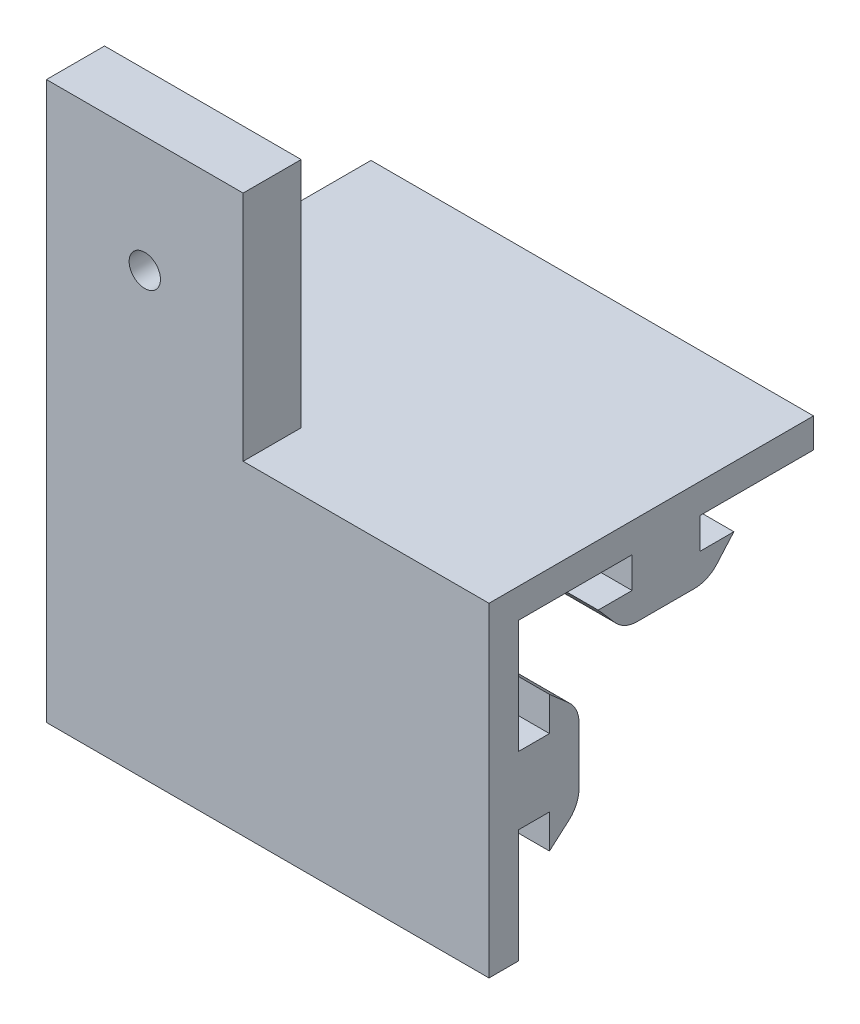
ISO-10303-21;
HEADER;
FILE_DESCRIPTION(('STEP AP214'),'2;1');
FILE_NAME('part.step','',(''),(''),'','','');
FILE_SCHEMA(('AUTOMOTIVE_DESIGN { 1 0 10303 214 1 1 1 1 }'));
ENDSEC;
DATA;
#1=APPLICATION_CONTEXT('core data for automotive mechanical design processes');
#2=APPLICATION_PROTOCOL_DEFINITION('international standard','automotive_design',2000,#1);
#3=PRODUCT_CONTEXT('',#1,'mechanical');
#4=PRODUCT('Part','Part','',(#3));
#5=PRODUCT_RELATED_PRODUCT_CATEGORY('part','',(#4));
#6=PRODUCT_DEFINITION_FORMATION('','',#4);
#7=PRODUCT_DEFINITION_CONTEXT('part definition',#1,'design');
#8=PRODUCT_DEFINITION('design','',#6,#7);
#9=PRODUCT_DEFINITION_SHAPE('','',#8);
#10=(LENGTH_UNIT() NAMED_UNIT(*) SI_UNIT(.MILLI.,.METRE.));
#11=(NAMED_UNIT(*) PLANE_ANGLE_UNIT() SI_UNIT($,.RADIAN.));
#12=(NAMED_UNIT(*) SI_UNIT($,.STERADIAN.) SOLID_ANGLE_UNIT());
#13=UNCERTAINTY_MEASURE_WITH_UNIT(LENGTH_MEASURE(1.E-05),#10,'distance_accuracy_value','');
#14=(GEOMETRIC_REPRESENTATION_CONTEXT(3) GLOBAL_UNCERTAINTY_ASSIGNED_CONTEXT((#13)) GLOBAL_UNIT_ASSIGNED_CONTEXT((#10,
#11,#12)) REPRESENTATION_CONTEXT('',''));
#15=CARTESIAN_POINT('',(0.,0.,0.));
#16=DIRECTION('',(0.,0.,1.));
#17=DIRECTION('',(1.,0.,0.));
#18=AXIS2_PLACEMENT_3D('',#15,#16,#17);
#19=CARTESIAN_POINT('',(0.,0.,0.));
#20=DIRECTION('',(0.,0.,-1.));
#21=DIRECTION('',(-1.,0.,0.));
#22=AXIS2_PLACEMENT_3D('',#19,#20,#21);
#23=PLANE('',#22);
#24=DIRECTION('',(0.,-1.,0.));
#25=VECTOR('',#24,1.);
#26=CARTESIAN_POINT('',(-29.21,0.,0.));
#27=LINE('',#26,#25);
#28=CARTESIAN_POINT('',(-29.21,12.7,0.));
#29=VERTEX_POINT('',#28);
#30=CARTESIAN_POINT('',(-29.21,2.921,0.));
#31=VERTEX_POINT('',#30);
#32=EDGE_CURVE('E439',#29,#31,#27,.T.);
#33=ORIENTED_EDGE('',*,*,#32,.F.);
#34=DIRECTION('',(-1.,0.,0.));
#35=VECTOR('',#34,1.);
#36=CARTESIAN_POINT('',(0.,12.7,0.));
#37=LINE('',#36,#35);
#38=CARTESIAN_POINT('',(8.89000000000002,12.7,0.));
#39=VERTEX_POINT('',#38);
#40=EDGE_CURVE('E334',#39,#29,#37,.T.);
#41=ORIENTED_EDGE('',*,*,#40,.F.);
#42=DIRECTION('',(0.,1.,0.));
#43=VECTOR('',#42,1.);
#44=CARTESIAN_POINT('',(8.89000000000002,0.,0.));
#45=LINE('',#44,#43);
#46=CARTESIAN_POINT('',(8.89000000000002,2.921,0.));
#47=VERTEX_POINT('',#46);
#48=EDGE_CURVE('E318',#47,#39,#45,.T.);
#49=ORIENTED_EDGE('',*,*,#48,.F.);
#50=DIRECTION('',(-1.,0.,0.));
#51=VECTOR('',#50,1.);
#52=CARTESIAN_POINT('',(41.91,2.921,0.));
#53=LINE('',#52,#51);
#54=EDGE_CURVE('E260',#47,#31,#53,.T.);
#55=ORIENTED_EDGE('',*,*,#54,.T.);
#56=EDGE_LOOP('',(#33,#41,#49,#55));
#57=FACE_BOUND('',#56,.T.);
#58=ADVANCED_FACE('F45',(#57),#23,.T.);
#59=CARTESIAN_POINT('',(-41.91,-12.7,12.7));
#60=DIRECTION('',(0.,1.,0.));
#61=DIRECTION('',(0.,0.,1.));
#62=AXIS2_PLACEMENT_3D('',#59,#60,#61);
#63=PLANE('',#62);
#64=DIRECTION('',(-1.,0.,0.));
#65=VECTOR('',#64,1.);
#66=CARTESIAN_POINT('',(41.91,-12.7,2.54));
#67=LINE('',#66,#65);
#68=CARTESIAN_POINT('',(8.89000000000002,-12.7,2.54));
#69=VERTEX_POINT('',#68);
#70=CARTESIAN_POINT('',(-29.21,-12.7,2.54));
#71=VERTEX_POINT('',#70);
#72=EDGE_CURVE('E249',#69,#71,#67,.T.);
#73=ORIENTED_EDGE('',*,*,#72,.T.);
#74=DIRECTION('',(0.,0.,1.));
#75=VECTOR('',#74,1.);
#76=CARTESIAN_POINT('',(-29.21,-12.7,-25.4000000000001));
#77=LINE('',#76,#75);
#78=CARTESIAN_POINT('',(-29.21,-12.7,0.));
#79=VERTEX_POINT('',#78);
#80=EDGE_CURVE('E234',#79,#71,#77,.T.);
#81=ORIENTED_EDGE('',*,*,#80,.F.);
#82=DIRECTION('',(1.,0.,0.));
#83=VECTOR('',#82,1.);
#84=CARTESIAN_POINT('',(-41.91,-12.7,0.));
#85=LINE('',#84,#83);
#86=CARTESIAN_POINT('',(8.89000000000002,-12.7,0.));
#87=VERTEX_POINT('',#86);
#88=EDGE_CURVE('E54',#79,#87,#85,.T.);
#89=ORIENTED_EDGE('',*,*,#88,.T.);
#90=DIRECTION('',(0.,0.,1.));
#91=VECTOR('',#90,1.);
#92=CARTESIAN_POINT('',(8.89000000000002,-12.7,-5.207));
#93=LINE('',#92,#91);
#94=EDGE_CURVE('E255',#87,#69,#93,.T.);
#95=ORIENTED_EDGE('',*,*,#94,.T.);
#96=EDGE_LOOP('',(#73,#81,#89,#95));
#97=FACE_BOUND('',#96,.T.);
#98=ADVANCED_FACE('F47',(#97),#63,.F.);
#99=DIRECTION('',(0.,-1.,0.));
#100=VECTOR('',#99,1.);
#101=CARTESIAN_POINT('',(-29.21,0.,0.));
#102=LINE('',#101,#100);
#103=CARTESIAN_POINT('',(-29.21,-2.921,0.));
#104=VERTEX_POINT('',#103);
#105=EDGE_CURVE('E237',#104,#79,#102,.T.);
#106=ORIENTED_EDGE('',*,*,#105,.F.);
#107=DIRECTION('',(-1.,0.,0.));
#108=VECTOR('',#107,1.);
#109=CARTESIAN_POINT('',(41.91,-2.921,0.));
#110=LINE('',#109,#108);
#111=CARTESIAN_POINT('',(8.89000000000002,-2.921,0.));
#112=VERTEX_POINT('',#111);
#113=EDGE_CURVE('E256',#112,#104,#110,.T.);
#114=ORIENTED_EDGE('',*,*,#113,.F.);
#115=DIRECTION('',(0.,1.,0.));
#116=VECTOR('',#115,1.);
#117=CARTESIAN_POINT('',(8.89000000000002,0.,0.));
#118=LINE('',#117,#116);
#119=EDGE_CURVE('E257',#87,#112,#118,.T.);
#120=ORIENTED_EDGE('',*,*,#119,.F.);
#121=ORIENTED_EDGE('',*,*,#88,.F.);
#122=EDGE_LOOP('',(#106,#114,#120,#121));
#123=FACE_BOUND('',#122,.T.);
#124=ADVANCED_FACE('F304',(#123),#23,.T.);
#125=CARTESIAN_POINT('',(41.91,-2.921,-2.667));
#126=DIRECTION('',(0.,-1.,0.));
#127=DIRECTION('',(0.,0.,-1.));
#128=AXIS2_PLACEMENT_3D('',#125,#126,#127);
#129=PLANE('',#128);
#130=DIRECTION('',(0.,0.,1.));
#131=VECTOR('',#130,1.);
#132=CARTESIAN_POINT('',(-29.21,-2.921,-2.667));
#133=LINE('',#132,#131);
#134=CARTESIAN_POINT('',(-29.21,-2.921,-2.667));
#135=VERTEX_POINT('',#134);
#136=EDGE_CURVE('E309',#135,#104,#133,.T.);
#137=ORIENTED_EDGE('',*,*,#136,.F.);
#138=DIRECTION('',(-1.,0.,0.));
#139=VECTOR('',#138,1.);
#140=CARTESIAN_POINT('',(41.91,-2.921,-2.667));
#141=LINE('',#140,#139);
#142=CARTESIAN_POINT('',(8.89000000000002,-2.921,-2.667));
#143=VERTEX_POINT('',#142);
#144=EDGE_CURVE('E266',#143,#135,#141,.T.);
#145=ORIENTED_EDGE('',*,*,#144,.F.);
#146=DIRECTION('',(0.,0.,-1.));
#147=VECTOR('',#146,1.);
#148=CARTESIAN_POINT('',(8.89000000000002,-2.921,-2.667));
#149=LINE('',#148,#147);
#150=EDGE_CURVE('E262',#112,#143,#149,.T.);
#151=ORIENTED_EDGE('',*,*,#150,.F.);
#152=ORIENTED_EDGE('',*,*,#113,.T.);
#153=EDGE_LOOP('',(#137,#145,#151,#152));
#154=FACE_BOUND('',#153,.T.);
#155=ADVANCED_FACE('F307',(#154),#129,.T.);
#156=CARTESIAN_POINT('',(41.91,-5.842,-2.667));
#157=DIRECTION('',(0.,0.,1.));
#158=DIRECTION('',(0.,-1.,0.));
#159=AXIS2_PLACEMENT_3D('',#156,#157,#158);
#160=PLANE('',#159);
#161=DIRECTION('',(0.,1.,0.));
#162=VECTOR('',#161,1.);
#163=CARTESIAN_POINT('',(-29.21,-5.842,-2.667));
#164=LINE('',#163,#162);
#165=CARTESIAN_POINT('',(-29.21,-5.842,-2.667));
#166=VERTEX_POINT('',#165);
#167=EDGE_CURVE('E423',#166,#135,#164,.T.);
#168=ORIENTED_EDGE('',*,*,#167,.F.);
#169=DIRECTION('',(-1.,0.,0.));
#170=VECTOR('',#169,1.);
#171=CARTESIAN_POINT('',(41.91,-5.842,-2.667));
#172=LINE('',#171,#170);
#173=CARTESIAN_POINT('',(8.89000000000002,-5.842,-2.667));
#174=VERTEX_POINT('',#173);
#175=EDGE_CURVE('E269',#174,#166,#172,.T.);
#176=ORIENTED_EDGE('',*,*,#175,.F.);
#177=DIRECTION('',(0.,-1.,0.));
#178=VECTOR('',#177,1.);
#179=CARTESIAN_POINT('',(8.89000000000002,-5.842,-2.667));
#180=LINE('',#179,#178);
#181=EDGE_CURVE('E311',#143,#174,#180,.T.);
#182=ORIENTED_EDGE('',*,*,#181,.F.);
#183=ORIENTED_EDGE('',*,*,#144,.T.);
#184=EDGE_LOOP('',(#168,#176,#182,#183));
#185=FACE_BOUND('',#184,.T.);
#186=ADVANCED_FACE('F500',(#185),#160,.T.);
#187=CARTESIAN_POINT('',(41.91,-4.37697550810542,-4.34022041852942));
#188=DIRECTION('',(0.,-0.752363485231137,-0.658748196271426));
#189=DIRECTION('',(0.,0.658748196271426,-0.752363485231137));
#190=AXIS2_PLACEMENT_3D('',#187,#188,#189);
#191=PLANE('',#190);
#192=DIRECTION('',(0.,-0.658748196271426,0.752363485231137));
#193=VECTOR('',#192,1.);
#194=CARTESIAN_POINT('',(-29.21,-4.37697550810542,-4.34022041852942));
#195=LINE('',#194,#193);
#196=CARTESIAN_POINT('',(-29.21,-4.37697550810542,-4.34022041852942));
#197=VERTEX_POINT('',#196);
#198=EDGE_CURVE('E425',#197,#166,#195,.T.);
#199=ORIENTED_EDGE('',*,*,#198,.F.);
#200=DIRECTION('',(-1.,0.,0.));
#201=VECTOR('',#200,1.);
#202=CARTESIAN_POINT('',(41.91,-4.37697550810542,-4.34022041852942));
#203=LINE('',#202,#201);
#204=CARTESIAN_POINT('',(8.89000000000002,-4.37697550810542,-4.34022041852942));
#205=VERTEX_POINT('',#204);
#206=EDGE_CURVE('E272',#205,#197,#203,.T.);
#207=ORIENTED_EDGE('',*,*,#206,.F.);
#208=DIRECTION('',(0.,0.658748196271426,-0.752363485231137));
#209=VECTOR('',#208,1.);
#210=CARTESIAN_POINT('',(8.89000000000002,-4.37697550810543,-4.34022041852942));
#211=LINE('',#210,#209);
#212=EDGE_CURVE('E312',#174,#205,#211,.T.);
#213=ORIENTED_EDGE('',*,*,#212,.F.);
#214=ORIENTED_EDGE('',*,*,#175,.T.);
#215=EDGE_LOOP('',(#199,#207,#213,#214));
#216=FACE_BOUND('',#215,.T.);
#217=ADVANCED_FACE('F504',(#216),#191,.T.);
#218=CARTESIAN_POINT('',(41.91,-2.46597225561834,-2.667));
#219=DIRECTION('',(-1.,0.,0.));
#220=DIRECTION('',(0.,0.,1.));
#221=AXIS2_PLACEMENT_3D('',#218,#219,#220);
#222=CYLINDRICAL_SURFACE('',#221,2.54);
#223=CARTESIAN_POINT('',(-29.21,-2.46597225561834,-2.667));
#224=DIRECTION('',(1.,0.,0.));
#225=DIRECTION('',(0.,0.,-1.));
#226=AXIS2_PLACEMENT_3D('',#223,#224,#225);
#227=CIRCLE('',#226,2.54);
#228=CARTESIAN_POINT('',(-29.21,-2.46597225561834,-5.207));
#229=VERTEX_POINT('',#228);
#230=EDGE_CURVE('E427',#229,#197,#227,.F.);
#231=ORIENTED_EDGE('',*,*,#230,.F.);
#232=DIRECTION('',(-1.,0.,0.));
#233=VECTOR('',#232,1.);
#234=CARTESIAN_POINT('',(41.91,-2.46597225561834,-5.207));
#235=LINE('',#234,#233);
#236=CARTESIAN_POINT('',(8.89000000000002,-2.46597225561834,-5.207));
#237=VERTEX_POINT('',#236);
#238=EDGE_CURVE('E275',#237,#229,#235,.T.);
#239=ORIENTED_EDGE('',*,*,#238,.F.);
#240=CARTESIAN_POINT('',(8.89000000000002,-2.46597225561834,-2.667));
#241=DIRECTION('',(-1.,0.,0.));
#242=DIRECTION('',(0.,-1.,0.));
#243=AXIS2_PLACEMENT_3D('',#240,#241,#242);
#244=CIRCLE('',#243,2.54);
#245=EDGE_CURVE('E316',#205,#237,#244,.F.);
#246=ORIENTED_EDGE('',*,*,#245,.F.);
#247=ORIENTED_EDGE('',*,*,#206,.T.);
#248=EDGE_LOOP('',(#231,#239,#246,#247));
#249=FACE_BOUND('',#248,.T.);
#250=ADVANCED_FACE('F527',(#249),#222,.T.);
#251=CARTESIAN_POINT('',(41.91,2.46597225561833,-5.207));
#252=DIRECTION('',(0.,0.,-1.));
#253=DIRECTION('',(0.,1.,0.));
#254=AXIS2_PLACEMENT_3D('',#251,#252,#253);
#255=PLANE('',#254);
#256=DIRECTION('',(0.,-1.,0.));
#257=VECTOR('',#256,1.);
#258=CARTESIAN_POINT('',(-29.21,2.46597225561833,-5.207));
#259=LINE('',#258,#257);
#260=CARTESIAN_POINT('',(-29.21,2.46597225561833,-5.207));
#261=VERTEX_POINT('',#260);
#262=EDGE_CURVE('E429',#261,#229,#259,.T.);
#263=ORIENTED_EDGE('',*,*,#262,.F.);
#264=DIRECTION('',(-1.,0.,0.));
#265=VECTOR('',#264,1.);
#266=CARTESIAN_POINT('',(41.91,2.46597225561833,-5.207));
#267=LINE('',#266,#265);
#268=CARTESIAN_POINT('',(8.89000000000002,2.46597225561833,-5.207));
#269=VERTEX_POINT('',#268);
#270=EDGE_CURVE('E278',#269,#261,#267,.T.);
#271=ORIENTED_EDGE('',*,*,#270,.F.);
#272=DIRECTION('',(0.,-1.,0.));
#273=VECTOR('',#272,1.);
#274=CARTESIAN_POINT('',(8.89000000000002,12.7,-5.207));
#275=LINE('',#274,#273);
#276=EDGE_CURVE('E301',#269,#237,#275,.T.);
#277=ORIENTED_EDGE('',*,*,#276,.T.);
#278=ORIENTED_EDGE('',*,*,#238,.T.);
#279=EDGE_LOOP('',(#263,#271,#277,#278));
#280=FACE_BOUND('',#279,.T.);
#281=ADVANCED_FACE('F523',(#280),#255,.T.);
#282=CARTESIAN_POINT('',(41.91,2.46597225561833,-2.667));
#283=DIRECTION('',(-1.,0.,0.));
#284=DIRECTION('',(0.,0.,1.));
#285=AXIS2_PLACEMENT_3D('',#282,#283,#284);
#286=CYLINDRICAL_SURFACE('',#285,2.54);
#287=CARTESIAN_POINT('',(-29.21,2.46597225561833,-2.667));
#288=DIRECTION('',(1.,0.,0.));
#289=DIRECTION('',(0.,0.,-1.));
#290=AXIS2_PLACEMENT_3D('',#287,#288,#289);
#291=CIRCLE('',#290,2.54);
#292=CARTESIAN_POINT('',(-29.21,4.37697550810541,-4.34022041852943));
#293=VERTEX_POINT('',#292);
#294=EDGE_CURVE('E431',#293,#261,#291,.F.);
#295=ORIENTED_EDGE('',*,*,#294,.F.);
#296=DIRECTION('',(-1.,0.,0.));
#297=VECTOR('',#296,1.);
#298=CARTESIAN_POINT('',(41.91,4.37697550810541,-4.34022041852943));
#299=LINE('',#298,#297);
#300=CARTESIAN_POINT('',(8.89000000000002,4.37697550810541,-4.34022041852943));
#301=VERTEX_POINT('',#300);
#302=EDGE_CURVE('E281',#301,#293,#299,.T.);
#303=ORIENTED_EDGE('',*,*,#302,.F.);
#304=CARTESIAN_POINT('',(8.89000000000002,2.46597225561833,-2.667));
#305=DIRECTION('',(-1.,0.,0.));
#306=DIRECTION('',(0.,-1.,0.));
#307=AXIS2_PLACEMENT_3D('',#304,#305,#306);
#308=CIRCLE('',#307,2.54);
#309=EDGE_CURVE('E320',#269,#301,#308,.F.);
#310=ORIENTED_EDGE('',*,*,#309,.F.);
#311=ORIENTED_EDGE('',*,*,#270,.T.);
#312=EDGE_LOOP('',(#295,#303,#310,#311));
#313=FACE_BOUND('',#312,.T.);
#314=ADVANCED_FACE('F519',(#313),#286,.T.);
#315=CARTESIAN_POINT('',(41.91,4.37697550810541,-4.34022041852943));
#316=DIRECTION('',(0.,0.752363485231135,-0.658748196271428));
#317=DIRECTION('',(0.,0.658748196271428,0.752363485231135));
#318=AXIS2_PLACEMENT_3D('',#315,#316,#317);
#319=PLANE('',#318);
#320=DIRECTION('',(0.,-0.658748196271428,-0.752363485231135));
#321=VECTOR('',#320,1.);
#322=CARTESIAN_POINT('',(-29.21,4.37697550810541,-4.34022041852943));
#323=LINE('',#322,#321);
#324=CARTESIAN_POINT('',(-29.21,5.842,-2.667));
#325=VERTEX_POINT('',#324);
#326=EDGE_CURVE('E433',#325,#293,#323,.T.);
#327=ORIENTED_EDGE('',*,*,#326,.F.);
#328=DIRECTION('',(-1.,0.,0.));
#329=VECTOR('',#328,1.);
#330=CARTESIAN_POINT('',(41.91,5.842,-2.667));
#331=LINE('',#330,#329);
#332=CARTESIAN_POINT('',(8.89000000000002,5.842,-2.667));
#333=VERTEX_POINT('',#332);
#334=EDGE_CURVE('E284',#333,#325,#331,.T.);
#335=ORIENTED_EDGE('',*,*,#334,.F.);
#336=DIRECTION('',(0.,0.658748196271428,0.752363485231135));
#337=VECTOR('',#336,1.);
#338=CARTESIAN_POINT('',(8.89000000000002,4.37697550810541,-4.34022041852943));
#339=LINE('',#338,#337);
#340=EDGE_CURVE('E322',#301,#333,#339,.T.);
#341=ORIENTED_EDGE('',*,*,#340,.F.);
#342=ORIENTED_EDGE('',*,*,#302,.T.);
#343=EDGE_LOOP('',(#327,#335,#341,#342));
#344=FACE_BOUND('',#343,.T.);
#345=ADVANCED_FACE('F515',(#344),#319,.T.);
#346=CARTESIAN_POINT('',(41.91,5.842,-2.667));
#347=DIRECTION('',(0.,0.,1.));
#348=DIRECTION('',(0.,-1.,0.));
#349=AXIS2_PLACEMENT_3D('',#346,#347,#348);
#350=PLANE('',#349);
#351=DIRECTION('',(0.,1.,0.));
#352=VECTOR('',#351,1.);
#353=CARTESIAN_POINT('',(-29.21,5.842,-2.667));
#354=LINE('',#353,#352);
#355=CARTESIAN_POINT('',(-29.21,2.921,-2.667));
#356=VERTEX_POINT('',#355);
#357=EDGE_CURVE('E435',#356,#325,#354,.T.);
#358=ORIENTED_EDGE('',*,*,#357,.F.);
#359=DIRECTION('',(-1.,0.,0.));
#360=VECTOR('',#359,1.);
#361=CARTESIAN_POINT('',(41.91,2.921,-2.667));
#362=LINE('',#361,#360);
#363=CARTESIAN_POINT('',(8.89000000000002,2.921,-2.667));
#364=VERTEX_POINT('',#363);
#365=EDGE_CURVE('E287',#364,#356,#362,.T.);
#366=ORIENTED_EDGE('',*,*,#365,.F.);
#367=DIRECTION('',(0.,-1.,0.));
#368=VECTOR('',#367,1.);
#369=CARTESIAN_POINT('',(8.89000000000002,5.842,-2.667));
#370=LINE('',#369,#368);
#371=EDGE_CURVE('E324',#333,#364,#370,.T.);
#372=ORIENTED_EDGE('',*,*,#371,.F.);
#373=ORIENTED_EDGE('',*,*,#334,.T.);
#374=EDGE_LOOP('',(#358,#366,#372,#373));
#375=FACE_BOUND('',#374,.T.);
#376=ADVANCED_FACE('F511',(#375),#350,.T.);
#377=CARTESIAN_POINT('',(41.91,2.921,-2.667));
#378=DIRECTION('',(0.,1.,0.));
#379=DIRECTION('',(0.,0.,1.));
#380=AXIS2_PLACEMENT_3D('',#377,#378,#379);
#381=PLANE('',#380);
#382=DIRECTION('',(0.,0.,-1.));
#383=VECTOR('',#382,1.);
#384=CARTESIAN_POINT('',(-29.21,2.921,-2.667));
#385=LINE('',#384,#383);
#386=EDGE_CURVE('E437',#31,#356,#385,.T.);
#387=ORIENTED_EDGE('',*,*,#386,.F.);
#388=ORIENTED_EDGE('',*,*,#54,.F.);
#389=DIRECTION('',(0.,0.,1.));
#390=VECTOR('',#389,1.);
#391=CARTESIAN_POINT('',(8.89000000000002,2.921,-2.667));
#392=LINE('',#391,#390);
#393=EDGE_CURVE('E300',#364,#47,#392,.T.);
#394=ORIENTED_EDGE('',*,*,#393,.F.);
#395=ORIENTED_EDGE('',*,*,#365,.T.);
#396=EDGE_LOOP('',(#387,#388,#394,#395));
#397=FACE_BOUND('',#396,.T.);
#398=ADVANCED_FACE('F508',(#397),#381,.T.);
#399=CARTESIAN_POINT('',(41.91,12.7,2.54));
#400=DIRECTION('',(0.,0.,-1.));
#401=DIRECTION('',(0.,1.,0.));
#402=AXIS2_PLACEMENT_3D('',#399,#400,#401);
#403=PLANE('',#402);
#404=CARTESIAN_POINT('',(-20.745,25.24,2.54));
#405=DIRECTION('',(0.,0.,1.));
#406=DIRECTION('',(1.,0.,0.));
#407=AXIS2_PLACEMENT_3D('',#404,#405,#406);
#408=CIRCLE('',#407,1.35);
#409=CARTESIAN_POINT('',(-19.395,25.24,2.54));
#410=VERTEX_POINT('',#409);
#411=EDGE_CURVE('E469',#410,#410,#408,.T.);
#412=ORIENTED_EDGE('',*,*,#411,.F.);
#413=EDGE_LOOP('',(#412));
#414=FACE_BOUND('',#413,.T.);
#415=DIRECTION('',(1.,0.,0.));
#416=VECTOR('',#415,1.);
#417=CARTESIAN_POINT('',(-41.91,35.24,2.54));
#418=LINE('',#417,#416);
#419=CARTESIAN_POINT('',(-29.21,35.24,2.54));
#420=VERTEX_POINT('',#419);
#421=CARTESIAN_POINT('',(-12.28,35.24,2.54));
#422=VERTEX_POINT('',#421);
#423=EDGE_CURVE('E251',#420,#422,#418,.T.);
#424=ORIENTED_EDGE('',*,*,#423,.F.);
#425=DIRECTION('',(0.,1.,0.));
#426=VECTOR('',#425,1.);
#427=CARTESIAN_POINT('',(-29.21,-12.7,2.54));
#428=LINE('',#427,#426);
#429=EDGE_CURVE('E61',#71,#420,#428,.T.);
#430=ORIENTED_EDGE('',*,*,#429,.F.);
#431=ORIENTED_EDGE('',*,*,#72,.F.);
#432=DIRECTION('',(0.,-1.,0.));
#433=VECTOR('',#432,1.);
#434=CARTESIAN_POINT('',(8.89000000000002,12.7,2.54));
#435=LINE('',#434,#433);
#436=CARTESIAN_POINT('',(8.89000000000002,15.24,2.54));
#437=VERTEX_POINT('',#436);
#438=EDGE_CURVE('E299',#437,#69,#435,.T.);
#439=ORIENTED_EDGE('',*,*,#438,.F.);
#440=DIRECTION('',(1.,0.,0.));
#441=VECTOR('',#440,1.);
#442=CARTESIAN_POINT('',(-41.91,15.24,2.54));
#443=LINE('',#442,#441);
#444=CARTESIAN_POINT('',(-12.28,15.24,2.54));
#445=VERTEX_POINT('',#444);
#446=EDGE_CURVE('E332',#445,#437,#443,.T.);
#447=ORIENTED_EDGE('',*,*,#446,.F.);
#448=DIRECTION('',(0.,-1.,0.));
#449=VECTOR('',#448,1.);
#450=CARTESIAN_POINT('',(-12.28,35.24,2.54));
#451=LINE('',#450,#449);
#452=EDGE_CURVE('E405',#422,#445,#451,.T.);
#453=ORIENTED_EDGE('',*,*,#452,.F.);
#454=EDGE_LOOP('',(#424,#430,#431,#439,#447,#453));
#455=FACE_BOUND('',#454,.T.);
#456=ADVANCED_FACE('F247',(#414,#455),#403,.F.);
#457=CARTESIAN_POINT('',(8.89000000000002,12.7,-5.207));
#458=DIRECTION('',(-1.,0.,0.));
#459=DIRECTION('',(0.,-1.,0.));
#460=AXIS2_PLACEMENT_3D('',#457,#458,#459);
#461=PLANE('',#460);
#462=ORIENTED_EDGE('',*,*,#48,.T.);
#463=DIRECTION('',(0.,0.,1.));
#464=VECTOR('',#463,1.);
#465=CARTESIAN_POINT('',(8.89000000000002,12.6999999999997,-12.7));
#466=LINE('',#465,#464);
#467=CARTESIAN_POINT('',(8.89000000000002,12.6999999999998,-9.779));
#468=VERTEX_POINT('',#467);
#469=EDGE_CURVE('E387',#468,#39,#466,.T.);
#470=ORIENTED_EDGE('',*,*,#469,.F.);
#471=DIRECTION('',(0.,1.,0.));
#472=VECTOR('',#471,1.);
#473=CARTESIAN_POINT('',(8.89000000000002,10.0329999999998,-9.77899999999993));
#474=LINE('',#473,#472);
#475=CARTESIAN_POINT('',(8.89000000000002,10.0329999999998,-9.77899999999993));
#476=VERTEX_POINT('',#475);
#477=EDGE_CURVE('E398',#476,#468,#474,.T.);
#478=ORIENTED_EDGE('',*,*,#477,.F.);
#479=DIRECTION('',(0.,0.,-1.));
#480=VECTOR('',#479,1.);
#481=CARTESIAN_POINT('',(8.89000000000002,10.0329999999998,-6.85799999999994));
#482=LINE('',#481,#480);
#483=CARTESIAN_POINT('',(8.89000000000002,10.0329999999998,-6.85799999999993));
#484=VERTEX_POINT('',#483);
#485=EDGE_CURVE('E395',#484,#476,#482,.T.);
#486=ORIENTED_EDGE('',*,*,#485,.F.);
#487=DIRECTION('',(0.,0.752363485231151,0.65874819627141));
#488=VECTOR('',#487,1.);
#489=CARTESIAN_POINT('',(8.89000000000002,8.35977958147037,-8.32302449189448));
#490=LINE('',#489,#488);
#491=CARTESIAN_POINT('',(8.89000000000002,8.35977958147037,-8.32302449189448));
#492=VERTEX_POINT('',#491);
#493=EDGE_CURVE('E392',#492,#484,#490,.T.);
#494=ORIENTED_EDGE('',*,*,#493,.F.);
#495=CARTESIAN_POINT('',(8.89000000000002,10.0329999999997,-10.2340277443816));
#496=DIRECTION('',(1.,0.,0.));
#497=DIRECTION('',(0.,0.,-1.));
#498=AXIS2_PLACEMENT_3D('',#495,#496,#497);
#499=CIRCLE('',#498,2.54);
#500=CARTESIAN_POINT('',(8.89000000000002,7.49299999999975,-10.2340277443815));
#501=VERTEX_POINT('',#500);
#502=EDGE_CURVE('E389',#501,#492,#499,.F.);
#503=ORIENTED_EDGE('',*,*,#502,.F.);
#504=DIRECTION('',(0.,0.,-1.));
#505=VECTOR('',#504,1.);
#506=CARTESIAN_POINT('',(8.89000000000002,7.493,1.26634813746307E-13));
#507=LINE('',#506,#505);
#508=CARTESIAN_POINT('',(8.89000000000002,7.49299999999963,-15.1659722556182));
#509=VERTEX_POINT('',#508);
#510=EDGE_CURVE('E403',#501,#509,#507,.T.);
#511=ORIENTED_EDGE('',*,*,#510,.T.);
#512=CARTESIAN_POINT('',(8.89000000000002,10.0329999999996,-15.1659722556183));
#513=DIRECTION('',(1.,0.,0.));
#514=DIRECTION('',(0.,0.,-1.));
#515=AXIS2_PLACEMENT_3D('',#512,#513,#514);
#516=CIRCLE('',#515,2.54);
#517=CARTESIAN_POINT('',(8.89000000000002,8.35977958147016,-17.0769755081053));
#518=VERTEX_POINT('',#517);
#519=EDGE_CURVE('E384',#518,#509,#516,.F.);
#520=ORIENTED_EDGE('',*,*,#519,.F.);
#521=DIRECTION('',(0.,-0.752363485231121,0.658748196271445));
#522=VECTOR('',#521,1.);
#523=CARTESIAN_POINT('',(8.89000000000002,8.35977958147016,-17.0769755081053));
#524=LINE('',#523,#522);
#525=CARTESIAN_POINT('',(8.89000000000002,10.0329999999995,-18.5419999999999));
#526=VERTEX_POINT('',#525);
#527=EDGE_CURVE('E381',#526,#518,#524,.T.);
#528=ORIENTED_EDGE('',*,*,#527,.F.);
#529=DIRECTION('',(0.,0.,-1.));
#530=VECTOR('',#529,1.);
#531=CARTESIAN_POINT('',(8.89000000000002,10.0329999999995,-18.5419999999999));
#532=LINE('',#531,#530);
#533=CARTESIAN_POINT('',(8.89000000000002,10.0329999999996,-15.6209999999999));
#534=VERTEX_POINT('',#533);
#535=EDGE_CURVE('E378',#534,#526,#532,.T.);
#536=ORIENTED_EDGE('',*,*,#535,.F.);
#537=DIRECTION('',(0.,-1.,0.));
#538=VECTOR('',#537,1.);
#539=CARTESIAN_POINT('',(8.89000000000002,10.0329999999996,-15.6209999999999));
#540=LINE('',#539,#538);
#541=CARTESIAN_POINT('',(8.89000000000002,12.6999999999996,-15.621));
#542=VERTEX_POINT('',#541);
#543=EDGE_CURVE('E375',#542,#534,#540,.T.);
#544=ORIENTED_EDGE('',*,*,#543,.F.);
#545=DIRECTION('',(0.,0.,1.));
#546=VECTOR('',#545,1.);
#547=CARTESIAN_POINT('',(8.89000000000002,12.6999999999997,-12.7));
#548=LINE('',#547,#546);
#549=CARTESIAN_POINT('',(8.89000000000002,12.6999999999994,-25.4));
#550=VERTEX_POINT('',#549);
#551=EDGE_CURVE('E372',#550,#542,#548,.T.);
#552=ORIENTED_EDGE('',*,*,#551,.F.);
#553=DIRECTION('',(0.,1.,0.));
#554=VECTOR('',#553,1.);
#555=CARTESIAN_POINT('',(8.89000000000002,7.49299999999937,-25.3999999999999));
#556=LINE('',#555,#554);
#557=CARTESIAN_POINT('',(8.89000000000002,15.2399999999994,-25.4000000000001));
#558=VERTEX_POINT('',#557);
#559=EDGE_CURVE('E400',#550,#558,#556,.T.);
#560=ORIENTED_EDGE('',*,*,#559,.T.);
#561=DIRECTION('',(0.,0.,-1.));
#562=VECTOR('',#561,1.);
#563=CARTESIAN_POINT('',(8.89000000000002,15.24,0.));
#564=LINE('',#563,#562);
#565=EDGE_CURVE('E328',#437,#558,#564,.T.);
#566=ORIENTED_EDGE('',*,*,#565,.F.);
#567=ORIENTED_EDGE('',*,*,#438,.T.);
#568=ORIENTED_EDGE('',*,*,#94,.F.);
#569=ORIENTED_EDGE('',*,*,#119,.T.);
#570=ORIENTED_EDGE('',*,*,#150,.T.);
#571=ORIENTED_EDGE('',*,*,#181,.T.);
#572=ORIENTED_EDGE('',*,*,#212,.T.);
#573=ORIENTED_EDGE('',*,*,#245,.T.);
#574=ORIENTED_EDGE('',*,*,#276,.F.);
#575=ORIENTED_EDGE('',*,*,#309,.T.);
#576=ORIENTED_EDGE('',*,*,#340,.T.);
#577=ORIENTED_EDGE('',*,*,#371,.T.);
#578=ORIENTED_EDGE('',*,*,#393,.T.);
#579=EDGE_LOOP('',(#462,#470,#478,#486,#494,#503,#511,#520,#528,#536,#544,#552,#560,#566,#567,
#568,#569,#570,#571,#572,#573,#574,#575,#576,#577,#578));
#580=FACE_BOUND('',#579,.T.);
#581=ADVANCED_FACE('F296',(#580),#461,.F.);
#582=CARTESIAN_POINT('',(0.,15.24,0.));
#583=DIRECTION('',(0.,1.,0.));
#584=DIRECTION('',(0.,0.,1.));
#585=AXIS2_PLACEMENT_3D('',#582,#583,#584);
#586=PLANE('',#585);
#587=DIRECTION('',(0.,0.,-1.));
#588=VECTOR('',#587,1.);
#589=CARTESIAN_POINT('',(-29.21,15.24,0.));
#590=LINE('',#589,#588);
#591=CARTESIAN_POINT('',(-29.21,15.24,-2.46));
#592=VERTEX_POINT('',#591);
#593=CARTESIAN_POINT('',(-29.21,15.2399999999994,-25.4000000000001));
#594=VERTEX_POINT('',#593);
#595=EDGE_CURVE('E463',#592,#594,#590,.T.);
#596=ORIENTED_EDGE('',*,*,#595,.F.);
#597=DIRECTION('',(-1.,0.,0.));
#598=VECTOR('',#597,1.);
#599=CARTESIAN_POINT('',(-41.91,15.24,-2.46));
#600=LINE('',#599,#598);
#601=CARTESIAN_POINT('',(-12.28,15.24,-2.46));
#602=VERTEX_POINT('',#601);
#603=EDGE_CURVE('E412',#602,#592,#600,.T.);
#604=ORIENTED_EDGE('',*,*,#603,.F.);
#605=DIRECTION('',(0.,0.,-1.));
#606=VECTOR('',#605,1.);
#607=CARTESIAN_POINT('',(-12.28,15.24,2.54));
#608=LINE('',#607,#606);
#609=EDGE_CURVE('E68',#445,#602,#608,.T.);
#610=ORIENTED_EDGE('',*,*,#609,.F.);
#611=ORIENTED_EDGE('',*,*,#446,.T.);
#612=ORIENTED_EDGE('',*,*,#565,.T.);
#613=DIRECTION('',(-1.,0.,0.));
#614=VECTOR('',#613,1.);
#615=CARTESIAN_POINT('',(41.91,15.2399999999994,-25.4000000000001));
#616=LINE('',#615,#614);
#617=EDGE_CURVE('E344',#558,#594,#616,.T.);
#618=ORIENTED_EDGE('',*,*,#617,.T.);
#619=EDGE_LOOP('',(#596,#604,#610,#611,#612,#618));
#620=FACE_BOUND('',#619,.T.);
#621=ADVANCED_FACE('F540',(#620),#586,.T.);
#622=CARTESIAN_POINT('',(0.,12.6999999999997,-12.7));
#623=DIRECTION('',(0.,-1.,0.));
#624=DIRECTION('',(-1.,0.,0.));
#625=AXIS2_PLACEMENT_3D('',#622,#623,#624);
#626=PLANE('',#625);
#627=DIRECTION('',(0.,0.,1.));
#628=VECTOR('',#627,1.);
#629=CARTESIAN_POINT('',(-29.21,12.6999999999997,-12.7));
#630=LINE('',#629,#628);
#631=CARTESIAN_POINT('',(-29.21,12.6999999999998,-9.779));
#632=VERTEX_POINT('',#631);
#633=EDGE_CURVE('E441',#632,#29,#630,.T.);
#634=ORIENTED_EDGE('',*,*,#633,.F.);
#635=DIRECTION('',(-1.,0.,0.));
#636=VECTOR('',#635,1.);
#637=CARTESIAN_POINT('',(41.91,12.6999999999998,-9.779));
#638=LINE('',#637,#636);
#639=EDGE_CURVE('E343',#468,#632,#638,.T.);
#640=ORIENTED_EDGE('',*,*,#639,.F.);
#641=ORIENTED_EDGE('',*,*,#469,.T.);
#642=ORIENTED_EDGE('',*,*,#40,.T.);
#643=EDGE_LOOP('',(#634,#640,#641,#642));
#644=FACE_BOUND('',#643,.T.);
#645=ADVANCED_FACE('F543',(#644),#626,.T.);
#646=CARTESIAN_POINT('',(-41.91,25.3999999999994,-25.4000000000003));
#647=DIRECTION('',(0.,0.,1.));
#648=DIRECTION('',(0.,1.,0.));
#649=AXIS2_PLACEMENT_3D('',#646,#647,#648);
#650=PLANE('',#649);
#651=DIRECTION('',(1.,0.,0.));
#652=VECTOR('',#651,1.);
#653=CARTESIAN_POINT('',(-41.91,12.6999999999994,-25.4));
#654=LINE('',#653,#652);
#655=CARTESIAN_POINT('',(-29.21,12.6999999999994,-25.4000000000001));
#656=VERTEX_POINT('',#655);
#657=EDGE_CURVE('E337',#656,#550,#654,.T.);
#658=ORIENTED_EDGE('',*,*,#657,.F.);
#659=DIRECTION('',(0.,1.,0.));
#660=VECTOR('',#659,1.);
#661=CARTESIAN_POINT('',(-29.21,-12.7,-25.4000000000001));
#662=LINE('',#661,#660);
#663=EDGE_CURVE('E242',#656,#594,#662,.T.);
#664=ORIENTED_EDGE('',*,*,#663,.T.);
#665=ORIENTED_EDGE('',*,*,#617,.F.);
#666=ORIENTED_EDGE('',*,*,#559,.F.);
#667=EDGE_LOOP('',(#658,#664,#665,#666));
#668=FACE_BOUND('',#667,.T.);
#669=ADVANCED_FACE('F544',(#668),#650,.F.);
#670=DIRECTION('',(0.,0.,1.));
#671=VECTOR('',#670,1.);
#672=CARTESIAN_POINT('',(-29.21,12.6999999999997,-12.7));
#673=LINE('',#672,#671);
#674=CARTESIAN_POINT('',(-29.21,12.6999999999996,-15.621));
#675=VERTEX_POINT('',#674);
#676=EDGE_CURVE('E443',#656,#675,#673,.T.);
#677=ORIENTED_EDGE('',*,*,#676,.F.);
#678=ORIENTED_EDGE('',*,*,#657,.T.);
#679=ORIENTED_EDGE('',*,*,#551,.T.);
#680=DIRECTION('',(-1.,0.,0.));
#681=VECTOR('',#680,1.);
#682=CARTESIAN_POINT('',(41.91,12.6999999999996,-15.621));
#683=LINE('',#682,#681);
#684=EDGE_CURVE('E340',#542,#675,#683,.T.);
#685=ORIENTED_EDGE('',*,*,#684,.T.);
#686=EDGE_LOOP('',(#677,#678,#679,#685));
#687=FACE_BOUND('',#686,.T.);
#688=ADVANCED_FACE('F547',(#687),#626,.T.);
#689=CARTESIAN_POINT('',(41.91,10.0329999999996,-15.6209999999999));
#690=DIRECTION('',(0.,0.,-1.));
#691=DIRECTION('',(0.,-1.,0.));
#692=AXIS2_PLACEMENT_3D('',#689,#690,#691);
#693=PLANE('',#692);
#694=DIRECTION('',(0.,-1.,0.));
#695=VECTOR('',#694,1.);
#696=CARTESIAN_POINT('',(-29.21,10.0329999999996,-15.6209999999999));
#697=LINE('',#696,#695);
#698=CARTESIAN_POINT('',(-29.21,10.0329999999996,-15.6209999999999));
#699=VERTEX_POINT('',#698);
#700=EDGE_CURVE('E445',#675,#699,#697,.T.);
#701=ORIENTED_EDGE('',*,*,#700,.F.);
#702=ORIENTED_EDGE('',*,*,#684,.F.);
#703=ORIENTED_EDGE('',*,*,#543,.T.);
#704=DIRECTION('',(-1.,0.,0.));
#705=VECTOR('',#704,1.);
#706=CARTESIAN_POINT('',(41.91,10.0329999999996,-15.6209999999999));
#707=LINE('',#706,#705);
#708=EDGE_CURVE('E339',#534,#699,#707,.T.);
#709=ORIENTED_EDGE('',*,*,#708,.T.);
#710=EDGE_LOOP('',(#701,#702,#703,#709));
#711=FACE_BOUND('',#710,.T.);
#712=ADVANCED_FACE('F551',(#711),#693,.T.);
#713=CARTESIAN_POINT('',(41.91,10.0329999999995,-18.5419999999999));
#714=DIRECTION('',(0.,1.,0.));
#715=DIRECTION('',(0.,0.,-1.));
#716=AXIS2_PLACEMENT_3D('',#713,#714,#715);
#717=PLANE('',#716);
#718=DIRECTION('',(0.,0.,-1.));
#719=VECTOR('',#718,1.);
#720=CARTESIAN_POINT('',(-29.21,10.0329999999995,-18.5419999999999));
#721=LINE('',#720,#719);
#722=CARTESIAN_POINT('',(-29.21,10.0329999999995,-18.5419999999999));
#723=VERTEX_POINT('',#722);
#724=EDGE_CURVE('E447',#699,#723,#721,.T.);
#725=ORIENTED_EDGE('',*,*,#724,.F.);
#726=ORIENTED_EDGE('',*,*,#708,.F.);
#727=ORIENTED_EDGE('',*,*,#535,.T.);
#728=DIRECTION('',(-1.,0.,0.));
#729=VECTOR('',#728,1.);
#730=CARTESIAN_POINT('',(41.91,10.0329999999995,-18.5419999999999));
#731=LINE('',#730,#729);
#732=EDGE_CURVE('E365',#526,#723,#731,.T.);
#733=ORIENTED_EDGE('',*,*,#732,.T.);
#734=EDGE_LOOP('',(#725,#726,#727,#733));
#735=FACE_BOUND('',#734,.T.);
#736=ADVANCED_FACE('F555',(#735),#717,.T.);
#737=CARTESIAN_POINT('',(41.91,8.35977958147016,-17.0769755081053));
#738=DIRECTION('',(0.,-0.658748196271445,-0.75236348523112));
#739=DIRECTION('',(0.,-0.75236348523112,0.658748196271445));
#740=AXIS2_PLACEMENT_3D('',#737,#738,#739);
#741=PLANE('',#740);
#742=DIRECTION('',(0.,-0.752363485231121,0.658748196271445));
#743=VECTOR('',#742,1.);
#744=CARTESIAN_POINT('',(-29.21,8.35977958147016,-17.0769755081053));
#745=LINE('',#744,#743);
#746=CARTESIAN_POINT('',(-29.21,8.35977958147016,-17.0769755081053));
#747=VERTEX_POINT('',#746);
#748=EDGE_CURVE('E449',#723,#747,#745,.T.);
#749=ORIENTED_EDGE('',*,*,#748,.F.);
#750=ORIENTED_EDGE('',*,*,#732,.F.);
#751=ORIENTED_EDGE('',*,*,#527,.T.);
#752=DIRECTION('',(-1.,0.,0.));
#753=VECTOR('',#752,1.);
#754=CARTESIAN_POINT('',(41.91,8.35977958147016,-17.0769755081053));
#755=LINE('',#754,#753);
#756=EDGE_CURVE('E362',#518,#747,#755,.T.);
#757=ORIENTED_EDGE('',*,*,#756,.T.);
#758=EDGE_LOOP('',(#749,#750,#751,#757));
#759=FACE_BOUND('',#758,.T.);
#760=ADVANCED_FACE('F581',(#759),#741,.T.);
#761=CARTESIAN_POINT('',(41.91,10.0329999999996,-15.1659722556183));
#762=DIRECTION('',(-1.,0.,0.));
#763=DIRECTION('',(0.,1.,0.));
#764=AXIS2_PLACEMENT_3D('',#761,#762,#763);
#765=CYLINDRICAL_SURFACE('',#764,2.54);
#766=CARTESIAN_POINT('',(-29.21,10.0329999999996,-15.1659722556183));
#767=DIRECTION('',(1.,0.,0.));
#768=DIRECTION('',(0.,0.,-1.));
#769=AXIS2_PLACEMENT_3D('',#766,#767,#768);
#770=CIRCLE('',#769,2.54);
#771=CARTESIAN_POINT('',(-29.21,7.49299999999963,-15.1659722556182));
#772=VERTEX_POINT('',#771);
#773=EDGE_CURVE('E451',#747,#772,#770,.F.);
#774=ORIENTED_EDGE('',*,*,#773,.F.);
#775=ORIENTED_EDGE('',*,*,#756,.F.);
#776=ORIENTED_EDGE('',*,*,#519,.T.);
#777=DIRECTION('',(-1.,0.,0.));
#778=VECTOR('',#777,1.);
#779=CARTESIAN_POINT('',(41.91,7.49299999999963,-15.1659722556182));
#780=LINE('',#779,#778);
#781=EDGE_CURVE('E359',#509,#772,#780,.T.);
#782=ORIENTED_EDGE('',*,*,#781,.T.);
#783=EDGE_LOOP('',(#774,#775,#776,#782));
#784=FACE_BOUND('',#783,.T.);
#785=ADVANCED_FACE('F577',(#784),#765,.T.);
#786=CARTESIAN_POINT('',(41.91,7.49299999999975,-10.2340277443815));
#787=DIRECTION('',(0.,-1.,0.));
#788=DIRECTION('',(0.,0.,1.));
#789=AXIS2_PLACEMENT_3D('',#786,#787,#788);
#790=PLANE('',#789);
#791=DIRECTION('',(0.,0.,1.));
#792=VECTOR('',#791,1.);
#793=CARTESIAN_POINT('',(-29.21,7.49299999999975,-10.2340277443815));
#794=LINE('',#793,#792);
#795=CARTESIAN_POINT('',(-29.21,7.49299999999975,-10.2340277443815));
#796=VERTEX_POINT('',#795);
#797=EDGE_CURVE('E453',#772,#796,#794,.T.);
#798=ORIENTED_EDGE('',*,*,#797,.F.);
#799=ORIENTED_EDGE('',*,*,#781,.F.);
#800=ORIENTED_EDGE('',*,*,#510,.F.);
#801=DIRECTION('',(-1.,0.,0.));
#802=VECTOR('',#801,1.);
#803=CARTESIAN_POINT('',(41.91,7.49299999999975,-10.2340277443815));
#804=LINE('',#803,#802);
#805=EDGE_CURVE('E356',#501,#796,#804,.T.);
#806=ORIENTED_EDGE('',*,*,#805,.T.);
#807=EDGE_LOOP('',(#798,#799,#800,#806));
#808=FACE_BOUND('',#807,.T.);
#809=ADVANCED_FACE('F573',(#808),#790,.T.);
#810=CARTESIAN_POINT('',(41.91,10.0329999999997,-10.2340277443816));
#811=DIRECTION('',(-1.,0.,0.));
#812=DIRECTION('',(0.,1.,0.));
#813=AXIS2_PLACEMENT_3D('',#810,#811,#812);
#814=CYLINDRICAL_SURFACE('',#813,2.54);
#815=CARTESIAN_POINT('',(-29.21,10.0329999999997,-10.2340277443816));
#816=DIRECTION('',(1.,0.,0.));
#817=DIRECTION('',(0.,0.,-1.));
#818=AXIS2_PLACEMENT_3D('',#815,#816,#817);
#819=CIRCLE('',#818,2.54);
#820=CARTESIAN_POINT('',(-29.21,8.35977958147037,-8.32302449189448));
#821=VERTEX_POINT('',#820);
#822=EDGE_CURVE('E455',#796,#821,#819,.F.);
#823=ORIENTED_EDGE('',*,*,#822,.F.);
#824=ORIENTED_EDGE('',*,*,#805,.F.);
#825=ORIENTED_EDGE('',*,*,#502,.T.);
#826=DIRECTION('',(-1.,0.,0.));
#827=VECTOR('',#826,1.);
#828=CARTESIAN_POINT('',(41.91,8.35977958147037,-8.32302449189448));
#829=LINE('',#828,#827);
#830=EDGE_CURVE('E353',#492,#821,#829,.T.);
#831=ORIENTED_EDGE('',*,*,#830,.T.);
#832=EDGE_LOOP('',(#823,#824,#825,#831));
#833=FACE_BOUND('',#832,.T.);
#834=ADVANCED_FACE('F569',(#833),#814,.T.);
#835=CARTESIAN_POINT('',(41.91,8.35977958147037,-8.32302449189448));
#836=DIRECTION('',(0.,-0.65874819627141,0.752363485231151));
#837=DIRECTION('',(0.,0.752363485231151,0.65874819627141));
#838=AXIS2_PLACEMENT_3D('',#835,#836,#837);
#839=PLANE('',#838);
#840=DIRECTION('',(0.,0.752363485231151,0.65874819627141));
#841=VECTOR('',#840,1.);
#842=CARTESIAN_POINT('',(-29.21,8.35977958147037,-8.32302449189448));
#843=LINE('',#842,#841);
#844=CARTESIAN_POINT('',(-29.21,10.0329999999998,-6.85799999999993));
#845=VERTEX_POINT('',#844);
#846=EDGE_CURVE('E457',#821,#845,#843,.T.);
#847=ORIENTED_EDGE('',*,*,#846,.F.);
#848=ORIENTED_EDGE('',*,*,#830,.F.);
#849=ORIENTED_EDGE('',*,*,#493,.T.);
#850=DIRECTION('',(-1.,0.,0.));
#851=VECTOR('',#850,1.);
#852=CARTESIAN_POINT('',(41.91,10.0329999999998,-6.85799999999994));
#853=LINE('',#852,#851);
#854=EDGE_CURVE('E350',#484,#845,#853,.T.);
#855=ORIENTED_EDGE('',*,*,#854,.T.);
#856=EDGE_LOOP('',(#847,#848,#849,#855));
#857=FACE_BOUND('',#856,.T.);
#858=ADVANCED_FACE('F565',(#857),#839,.T.);
#859=CARTESIAN_POINT('',(41.91,10.0329999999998,-6.85799999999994));
#860=DIRECTION('',(0.,1.,0.));
#861=DIRECTION('',(0.,0.,-1.));
#862=AXIS2_PLACEMENT_3D('',#859,#860,#861);
#863=PLANE('',#862);
#864=DIRECTION('',(0.,0.,-1.));
#865=VECTOR('',#864,1.);
#866=CARTESIAN_POINT('',(-29.21,10.0329999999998,-6.85799999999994));
#867=LINE('',#866,#865);
#868=CARTESIAN_POINT('',(-29.21,10.0329999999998,-9.77899999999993));
#869=VERTEX_POINT('',#868);
#870=EDGE_CURVE('E459',#845,#869,#867,.T.);
#871=ORIENTED_EDGE('',*,*,#870,.F.);
#872=ORIENTED_EDGE('',*,*,#854,.F.);
#873=ORIENTED_EDGE('',*,*,#485,.T.);
#874=DIRECTION('',(-1.,0.,0.));
#875=VECTOR('',#874,1.);
#876=CARTESIAN_POINT('',(41.91,10.0329999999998,-9.77899999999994));
#877=LINE('',#876,#875);
#878=EDGE_CURVE('E347',#476,#869,#877,.T.);
#879=ORIENTED_EDGE('',*,*,#878,.T.);
#880=EDGE_LOOP('',(#871,#872,#873,#879));
#881=FACE_BOUND('',#880,.T.);
#882=ADVANCED_FACE('F561',(#881),#863,.T.);
#883=CARTESIAN_POINT('',(41.91,10.0329999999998,-9.77899999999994));
#884=DIRECTION('',(0.,0.,1.));
#885=DIRECTION('',(0.,1.,0.));
#886=AXIS2_PLACEMENT_3D('',#883,#884,#885);
#887=PLANE('',#886);
#888=DIRECTION('',(0.,1.,0.));
#889=VECTOR('',#888,1.);
#890=CARTESIAN_POINT('',(-29.21,10.0329999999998,-9.77899999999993));
#891=LINE('',#890,#889);
#892=EDGE_CURVE('E461',#869,#632,#891,.T.);
#893=ORIENTED_EDGE('',*,*,#892,.F.);
#894=ORIENTED_EDGE('',*,*,#878,.F.);
#895=ORIENTED_EDGE('',*,*,#477,.T.);
#896=ORIENTED_EDGE('',*,*,#639,.T.);
#897=EDGE_LOOP('',(#893,#894,#895,#896));
#898=FACE_BOUND('',#897,.T.);
#899=ADVANCED_FACE('F557',(#898),#887,.T.);
#900=CARTESIAN_POINT('',(-12.28,35.24,2.54));
#901=DIRECTION('',(-1.,0.,0.));
#902=DIRECTION('',(0.,0.,1.));
#903=AXIS2_PLACEMENT_3D('',#900,#901,#902);
#904=PLANE('',#903);
#905=ORIENTED_EDGE('',*,*,#609,.T.);
#906=DIRECTION('',(0.,-1.,0.));
#907=VECTOR('',#906,1.);
#908=CARTESIAN_POINT('',(-12.28,35.24,-2.46));
#909=LINE('',#908,#907);
#910=CARTESIAN_POINT('',(-12.28,35.24,-2.46));
#911=VERTEX_POINT('',#910);
#912=EDGE_CURVE('E408',#911,#602,#909,.T.);
#913=ORIENTED_EDGE('',*,*,#912,.F.);
#914=DIRECTION('',(0.,0.,-1.));
#915=VECTOR('',#914,1.);
#916=CARTESIAN_POINT('',(-12.28,35.24,2.54));
#917=LINE('',#916,#915);
#918=EDGE_CURVE('E418',#422,#911,#917,.T.);
#919=ORIENTED_EDGE('',*,*,#918,.F.);
#920=ORIENTED_EDGE('',*,*,#452,.T.);
#921=EDGE_LOOP('',(#905,#913,#919,#920));
#922=FACE_BOUND('',#921,.T.);
#923=ADVANCED_FACE('F560',(#922),#904,.F.);
#924=CARTESIAN_POINT('',(-41.91,35.24,-2.46));
#925=DIRECTION('',(0.,0.,1.));
#926=DIRECTION('',(1.,0.,0.));
#927=AXIS2_PLACEMENT_3D('',#924,#925,#926);
#928=PLANE('',#927);
#929=CARTESIAN_POINT('',(-20.745,25.24,-2.46));
#930=DIRECTION('',(0.,0.,1.));
#931=DIRECTION('',(1.,0.,0.));
#932=AXIS2_PLACEMENT_3D('',#929,#930,#931);
#933=CIRCLE('',#932,1.35);
#934=CARTESIAN_POINT('',(-19.395,25.24,-2.46));
#935=VERTEX_POINT('',#934);
#936=EDGE_CURVE('E49',#935,#935,#933,.T.);
#937=ORIENTED_EDGE('',*,*,#936,.T.);
#938=EDGE_LOOP('',(#937));
#939=FACE_BOUND('',#938,.T.);
#940=ORIENTED_EDGE('',*,*,#603,.T.);
#941=DIRECTION('',(0.,1.,0.));
#942=VECTOR('',#941,1.);
#943=CARTESIAN_POINT('',(-29.21,35.24,-2.46));
#944=LINE('',#943,#942);
#945=CARTESIAN_POINT('',(-29.21,35.24,-2.46000000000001));
#946=VERTEX_POINT('',#945);
#947=EDGE_CURVE('E241',#592,#946,#944,.T.);
#948=ORIENTED_EDGE('',*,*,#947,.T.);
#949=DIRECTION('',(-1.,0.,0.));
#950=VECTOR('',#949,1.);
#951=CARTESIAN_POINT('',(-41.91,35.24,-2.46));
#952=LINE('',#951,#950);
#953=EDGE_CURVE('E411',#911,#946,#952,.T.);
#954=ORIENTED_EDGE('',*,*,#953,.F.);
#955=ORIENTED_EDGE('',*,*,#912,.T.);
#956=EDGE_LOOP('',(#940,#948,#954,#955));
#957=FACE_BOUND('',#956,.T.);
#958=ADVANCED_FACE('F476',(#939,#957),#928,.F.);
#959=CARTESIAN_POINT('',(0.,35.24,0.));
#960=DIRECTION('',(0.,-1.,0.));
#961=DIRECTION('',(0.,0.,-1.));
#962=AXIS2_PLACEMENT_3D('',#959,#960,#961);
#963=PLANE('',#962);
#964=ORIENTED_EDGE('',*,*,#953,.T.);
#965=DIRECTION('',(0.,0.,1.));
#966=VECTOR('',#965,1.);
#967=CARTESIAN_POINT('',(-29.21,35.24,0.));
#968=LINE('',#967,#966);
#969=EDGE_CURVE('E11',#946,#420,#968,.T.);
#970=ORIENTED_EDGE('',*,*,#969,.T.);
#971=ORIENTED_EDGE('',*,*,#423,.T.);
#972=ORIENTED_EDGE('',*,*,#918,.T.);
#973=EDGE_LOOP('',(#964,#970,#971,#972));
#974=FACE_BOUND('',#973,.T.);
#975=ADVANCED_FACE('F486',(#974),#963,.F.);
#976=CARTESIAN_POINT('',(-29.21,-12.7,-25.4000000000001));
#977=DIRECTION('',(1.,0.,0.));
#978=DIRECTION('',(0.,0.,-1.));
#979=AXIS2_PLACEMENT_3D('',#976,#977,#978);
#980=PLANE('',#979);
#981=ORIENTED_EDGE('',*,*,#105,.T.);
#982=ORIENTED_EDGE('',*,*,#80,.T.);
#983=ORIENTED_EDGE('',*,*,#429,.T.);
#984=ORIENTED_EDGE('',*,*,#969,.F.);
#985=ORIENTED_EDGE('',*,*,#947,.F.);
#986=ORIENTED_EDGE('',*,*,#595,.T.);
#987=ORIENTED_EDGE('',*,*,#663,.F.);
#988=ORIENTED_EDGE('',*,*,#676,.T.);
#989=ORIENTED_EDGE('',*,*,#700,.T.);
#990=ORIENTED_EDGE('',*,*,#724,.T.);
#991=ORIENTED_EDGE('',*,*,#748,.T.);
#992=ORIENTED_EDGE('',*,*,#773,.T.);
#993=ORIENTED_EDGE('',*,*,#797,.T.);
#994=ORIENTED_EDGE('',*,*,#822,.T.);
#995=ORIENTED_EDGE('',*,*,#846,.T.);
#996=ORIENTED_EDGE('',*,*,#870,.T.);
#997=ORIENTED_EDGE('',*,*,#892,.T.);
#998=ORIENTED_EDGE('',*,*,#633,.T.);
#999=ORIENTED_EDGE('',*,*,#32,.T.);
#1000=ORIENTED_EDGE('',*,*,#386,.T.);
#1001=ORIENTED_EDGE('',*,*,#357,.T.);
#1002=ORIENTED_EDGE('',*,*,#326,.T.);
#1003=ORIENTED_EDGE('',*,*,#294,.T.);
#1004=ORIENTED_EDGE('',*,*,#262,.T.);
#1005=ORIENTED_EDGE('',*,*,#230,.T.);
#1006=ORIENTED_EDGE('',*,*,#198,.T.);
#1007=ORIENTED_EDGE('',*,*,#167,.T.);
#1008=ORIENTED_EDGE('',*,*,#136,.T.);
#1009=EDGE_LOOP('',(#981,#982,#983,#984,#985,#986,#987,#988,#989,#990,#991,#992,#993,#994,#995,
#996,#997,#998,#999,#1000,#1001,#1002,#1003,#1004,#1005,#1006,#1007,#1008));
#1010=FACE_BOUND('',#1009,.T.);
#1011=ADVANCED_FACE('F235',(#1010),#980,.F.);
#1012=CARTESIAN_POINT('',(-20.745,25.24,-25.4000000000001));
#1013=DIRECTION('',(0.,0.,1.));
#1014=DIRECTION('',(1.,0.,0.));
#1015=AXIS2_PLACEMENT_3D('',#1012,#1013,#1014);
#1016=CYLINDRICAL_SURFACE('',#1015,1.35);
#1017=CARTESIAN_POINT('',(-19.395,25.24,2.54));
#1018=CARTESIAN_POINT('',(-19.395,25.24,2.48791666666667));
#1019=CARTESIAN_POINT('',(-19.395,25.24,2.43583333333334));
#1020=CARTESIAN_POINT('',(-19.395,25.24,2.33166666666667));
#1021=CARTESIAN_POINT('',(-19.395,25.24,2.27958333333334));
#1022=CARTESIAN_POINT('',(-19.395,25.24,2.17541666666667));
#1023=CARTESIAN_POINT('',(-19.395,25.24,2.12333333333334));
#1024=CARTESIAN_POINT('',(-19.395,25.24,2.01916666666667));
#1025=CARTESIAN_POINT('',(-19.395,25.24,1.96708333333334));
#1026=CARTESIAN_POINT('',(-19.395,25.24,1.86291666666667));
#1027=CARTESIAN_POINT('',(-19.395,25.24,1.81083333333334));
#1028=CARTESIAN_POINT('',(-19.395,25.24,1.70666666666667));
#1029=CARTESIAN_POINT('',(-19.395,25.24,1.65458333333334));
#1030=CARTESIAN_POINT('',(-19.395,25.24,1.55041666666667));
#1031=CARTESIAN_POINT('',(-19.395,25.24,1.49833333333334));
#1032=CARTESIAN_POINT('',(-19.395,25.24,1.39416666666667));
#1033=CARTESIAN_POINT('',(-19.395,25.24,1.34208333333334));
#1034=CARTESIAN_POINT('',(-19.395,25.24,1.23791666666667));
#1035=CARTESIAN_POINT('',(-19.395,25.24,1.18583333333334));
#1036=CARTESIAN_POINT('',(-19.395,25.24,1.08166666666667));
#1037=CARTESIAN_POINT('',(-19.395,25.24,1.02958333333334));
#1038=CARTESIAN_POINT('',(-19.395,25.24,0.925416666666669));
#1039=CARTESIAN_POINT('',(-19.395,25.24,0.873333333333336));
#1040=CARTESIAN_POINT('',(-19.395,25.24,0.769166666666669));
#1041=CARTESIAN_POINT('',(-19.395,25.24,0.717083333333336));
#1042=CARTESIAN_POINT('',(-19.395,25.24,0.612916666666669));
#1043=CARTESIAN_POINT('',(-19.395,25.24,0.560833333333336));
#1044=CARTESIAN_POINT('',(-19.395,25.24,0.456666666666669));
#1045=CARTESIAN_POINT('',(-19.395,25.24,0.404583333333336));
#1046=CARTESIAN_POINT('',(-19.395,25.24,0.300416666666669));
#1047=CARTESIAN_POINT('',(-19.395,25.24,0.248333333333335));
#1048=CARTESIAN_POINT('',(-19.395,25.24,0.144166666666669));
#1049=CARTESIAN_POINT('',(-19.395,25.24,0.0920833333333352));
#1050=CARTESIAN_POINT('',(-19.395,25.24,-0.0120833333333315));
#1051=CARTESIAN_POINT('',(-19.395,25.24,-0.0641666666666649));
#1052=CARTESIAN_POINT('',(-19.395,25.24,-0.168333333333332));
#1053=CARTESIAN_POINT('',(-19.395,25.24,-0.220416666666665));
#1054=CARTESIAN_POINT('',(-19.395,25.24,-0.324583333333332));
#1055=CARTESIAN_POINT('',(-19.395,25.24,-0.376666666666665));
#1056=CARTESIAN_POINT('',(-19.395,25.24,-0.480833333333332));
#1057=CARTESIAN_POINT('',(-19.395,25.24,-0.532916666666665));
#1058=CARTESIAN_POINT('',(-19.395,25.24,-0.637083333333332));
#1059=CARTESIAN_POINT('',(-19.395,25.24,-0.689166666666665));
#1060=CARTESIAN_POINT('',(-19.395,25.24,-0.793333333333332));
#1061=CARTESIAN_POINT('',(-19.395,25.24,-0.845416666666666));
#1062=CARTESIAN_POINT('',(-19.395,25.24,-0.949583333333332));
#1063=CARTESIAN_POINT('',(-19.395,25.24,-1.00166666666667));
#1064=CARTESIAN_POINT('',(-19.395,25.24,-1.10583333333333));
#1065=CARTESIAN_POINT('',(-19.395,25.24,-1.15791666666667));
#1066=CARTESIAN_POINT('',(-19.395,25.24,-1.26208333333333));
#1067=CARTESIAN_POINT('',(-19.395,25.24,-1.31416666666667));
#1068=CARTESIAN_POINT('',(-19.395,25.24,-1.41833333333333));
#1069=CARTESIAN_POINT('',(-19.395,25.24,-1.47041666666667));
#1070=CARTESIAN_POINT('',(-19.395,25.24,-1.57458333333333));
#1071=CARTESIAN_POINT('',(-19.395,25.24,-1.62666666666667));
#1072=CARTESIAN_POINT('',(-19.395,25.24,-1.73083333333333));
#1073=CARTESIAN_POINT('',(-19.395,25.24,-1.78291666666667));
#1074=CARTESIAN_POINT('',(-19.395,25.24,-1.88708333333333));
#1075=CARTESIAN_POINT('',(-19.395,25.24,-1.93916666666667));
#1076=CARTESIAN_POINT('',(-19.395,25.24,-2.04333333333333));
#1077=CARTESIAN_POINT('',(-19.395,25.24,-2.09541666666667));
#1078=CARTESIAN_POINT('',(-19.395,25.24,-2.19958333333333));
#1079=CARTESIAN_POINT('',(-19.395,25.24,-2.25166666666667));
#1080=CARTESIAN_POINT('',(-19.395,25.24,-2.35583333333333));
#1081=CARTESIAN_POINT('',(-19.395,25.24,-2.40791666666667));
#1082=CARTESIAN_POINT('',(-19.395,25.24,-2.46));
#1083=B_SPLINE_CURVE_WITH_KNOTS('',3,(#1017,#1018,#1019,#1020,#1021,#1022,#1023,#1024,#1025,
#1026,#1027,#1028,#1029,#1030,#1031,#1032,#1033,#1034,#1035,#1036,#1037,#1038,#1039,#1040,#1041,
#1042,#1043,#1044,#1045,#1046,#1047,#1048,#1049,#1050,#1051,#1052,#1053,#1054,#1055,#1056,#1057,
#1058,#1059,#1060,#1061,#1062,#1063,#1064,#1065,#1066,#1067,#1068,#1069,#1070,#1071,#1072,#1073,
#1074,#1075,#1076,#1077,#1078,#1079,#1080,#1081,#1082),.UNSPECIFIED.,.F.,.F.,(4,2,2,2,2,2,2,2,2,
2,2,2,2,2,2,2,2,2,2,2,2,2,2,2,2,2,2,2,2,2,2,2,4),(0.,0.15625,0.3125,0.46875,0.625000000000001,
0.781250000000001,0.937500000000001,1.09375,1.25,1.40625,1.5625,1.71875,1.875,2.03125,2.1875,
2.34375,2.5,2.65625,2.8125,2.96875,3.125,3.28125,3.4375,3.59375,3.75,3.90625,4.0625,4.21875,
4.375,4.53125,4.6875,4.84375,5.),.UNSPECIFIED.);
#1084=EDGE_CURVE('BSEAM479',#410,#935,#1083,.T.);
#1085=ORIENTED_EDGE('',*,*,#411,.T.);
#1086=ORIENTED_EDGE('',*,*,#936,.F.);
#1087=ORIENTED_EDGE('',*,*,#1084,.T.);
#1088=ORIENTED_EDGE('',*,*,#1084,.F.);
#1089=EDGE_LOOP('',(#1085,#1087,#1086,#1088));
#1090=FACE_BOUND('',#1089,.T.);
#1091=ADVANCED_FACE('F479',(#1090),#1016,.F.);
#1092=CLOSED_SHELL('',(#58,#98,#124,#155,#186,#217,#250,#281,#314,#345,#376,#398,#456,#581,#621,
#645,#669,#688,#712,#736,#760,#785,#809,#834,#858,#882,#899,#923,#958,#975,#1011,#1091));
#1093=MANIFOLD_SOLID_BREP('B2',#1092);
#1094=ADVANCED_BREP_SHAPE_REPRESENTATION('',(#18,#1093),#14);
#1095=SHAPE_DEFINITION_REPRESENTATION(#9,#1094);
ENDSEC;
END-ISO-10303-21;
